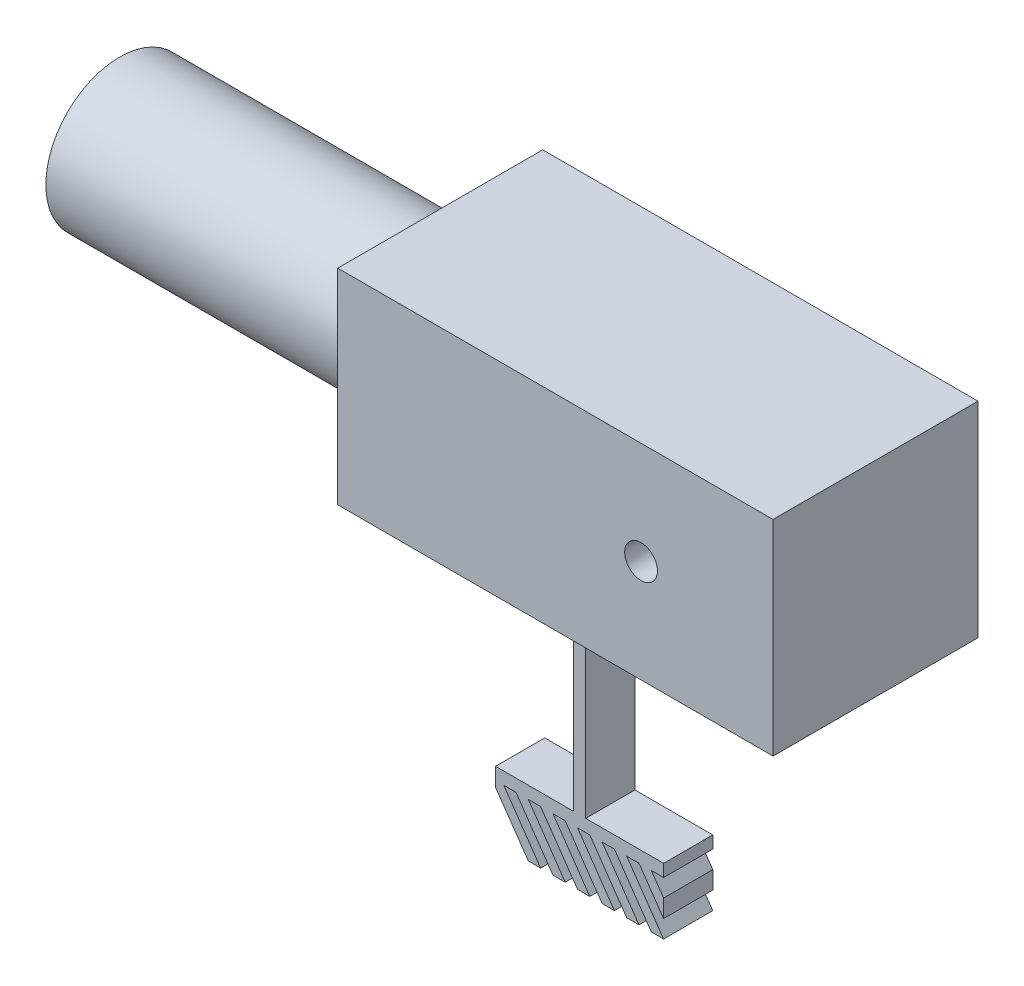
ISO-10303-21;
HEADER;
FILE_DESCRIPTION(('STEP AP214'),'2;1');
FILE_NAME('part.step','',(''),(''),'','','');
FILE_SCHEMA(('AUTOMOTIVE_DESIGN { 1 0 10303 214 1 1 1 1 }'));
ENDSEC;
DATA;
#1=APPLICATION_CONTEXT('core data for automotive mechanical design processes');
#2=APPLICATION_PROTOCOL_DEFINITION('international standard','automotive_design',2000,#1);
#3=PRODUCT_CONTEXT('',#1,'mechanical');
#4=PRODUCT('Part','Part','',(#3));
#5=PRODUCT_RELATED_PRODUCT_CATEGORY('part','',(#4));
#6=PRODUCT_DEFINITION_FORMATION('','',#4);
#7=PRODUCT_DEFINITION_CONTEXT('part definition',#1,'design');
#8=PRODUCT_DEFINITION('design','',#6,#7);
#9=PRODUCT_DEFINITION_SHAPE('','',#8);
#10=(LENGTH_UNIT() NAMED_UNIT(*) SI_UNIT(.MILLI.,.METRE.));
#11=(NAMED_UNIT(*) PLANE_ANGLE_UNIT() SI_UNIT($,.RADIAN.));
#12=(NAMED_UNIT(*) SI_UNIT($,.STERADIAN.) SOLID_ANGLE_UNIT());
#13=UNCERTAINTY_MEASURE_WITH_UNIT(LENGTH_MEASURE(1.E-05),#10,'distance_accuracy_value','');
#14=(GEOMETRIC_REPRESENTATION_CONTEXT(3) GLOBAL_UNCERTAINTY_ASSIGNED_CONTEXT((#13)) GLOBAL_UNIT_ASSIGNED_CONTEXT((#10,
#11,#12)) REPRESENTATION_CONTEXT('',''));
#15=CARTESIAN_POINT('',(0.,0.,0.));
#16=DIRECTION('',(0.,0.,1.));
#17=DIRECTION('',(1.,0.,0.));
#18=AXIS2_PLACEMENT_3D('',#15,#16,#17);
#19=CARTESIAN_POINT('',(-200.,-125.,-125.));
#20=DIRECTION('',(0.,0.,-1.));
#21=DIRECTION('',(-1.,0.,0.));
#22=AXIS2_PLACEMENT_3D('',#19,#20,#21);
#23=PLANE('',#22);
#24=DIRECTION('',(1.,0.,0.));
#25=VECTOR('',#24,1.);
#26=CARTESIAN_POINT('',(-200.,125.,-125.));
#27=LINE('',#26,#25);
#28=CARTESIAN_POINT('',(-200.,125.,-125.));
#29=VERTEX_POINT('',#28);
#30=CARTESIAN_POINT('',(331.,125.,-125.));
#31=VERTEX_POINT('',#30);
#32=EDGE_CURVE('E284',#29,#31,#27,.T.);
#33=ORIENTED_EDGE('',*,*,#32,.T.);
#34=DIRECTION('',(0.,1.,0.));
#35=VECTOR('',#34,1.);
#36=CARTESIAN_POINT('',(331.,-125.,-125.));
#37=LINE('',#36,#35);
#38=CARTESIAN_POINT('',(331.,-125.,-125.));
#39=VERTEX_POINT('',#38);
#40=EDGE_CURVE('E287',#39,#31,#37,.T.);
#41=ORIENTED_EDGE('',*,*,#40,.F.);
#42=DIRECTION('',(1.,0.,0.));
#43=VECTOR('',#42,1.);
#44=CARTESIAN_POINT('',(-200.,-125.,-125.));
#45=LINE('',#44,#43);
#46=CARTESIAN_POINT('',(-200.,-125.,-125.));
#47=VERTEX_POINT('',#46);
#48=EDGE_CURVE('E324',#47,#39,#45,.T.);
#49=ORIENTED_EDGE('',*,*,#48,.F.);
#50=DIRECTION('',(0.,1.,0.));
#51=VECTOR('',#50,1.);
#52=CARTESIAN_POINT('',(-200.,-125.,-125.));
#53=LINE('',#52,#51);
#54=EDGE_CURVE('E289',#47,#29,#53,.T.);
#55=ORIENTED_EDGE('',*,*,#54,.T.);
#56=EDGE_LOOP('',(#33,#41,#49,#55));
#57=FACE_BOUND('',#56,.T.);
#58=ADVANCED_FACE('F31',(#57),#23,.T.);
#59=CARTESIAN_POINT('',(-200.,-125.,125.));
#60=DIRECTION('',(0.,-1.,0.));
#61=DIRECTION('',(0.,0.,-1.));
#62=AXIS2_PLACEMENT_3D('',#59,#60,#61);
#63=PLANE('',#62);
#64=DIRECTION('',(0.,0.,-1.));
#65=VECTOR('',#64,1.);
#66=CARTESIAN_POINT('',(7.50000000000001,-125.,-30.));
#67=LINE('',#66,#65);
#68=CARTESIAN_POINT('',(7.5,-125.,30.));
#69=VERTEX_POINT('',#68);
#70=CARTESIAN_POINT('',(7.50000000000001,-125.,-30.));
#71=VERTEX_POINT('',#70);
#72=EDGE_CURVE('E326',#69,#71,#67,.T.);
#73=ORIENTED_EDGE('',*,*,#72,.T.);
#74=DIRECTION('',(-1.,0.,0.));
#75=VECTOR('',#74,1.);
#76=CARTESIAN_POINT('',(-7.50000000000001,-125.,-30.));
#77=LINE('',#76,#75);
#78=CARTESIAN_POINT('',(-7.50000000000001,-125.,-30.));
#79=VERTEX_POINT('',#78);
#80=EDGE_CURVE('E332',#71,#79,#77,.T.);
#81=ORIENTED_EDGE('',*,*,#80,.T.);
#82=DIRECTION('',(0.,0.,1.));
#83=VECTOR('',#82,1.);
#84=CARTESIAN_POINT('',(-7.50000000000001,-125.,-30.));
#85=LINE('',#84,#83);
#86=CARTESIAN_POINT('',(-7.50000000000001,-125.,30.));
#87=VERTEX_POINT('',#86);
#88=EDGE_CURVE('E47',#79,#87,#85,.T.);
#89=ORIENTED_EDGE('',*,*,#88,.T.);
#90=DIRECTION('',(-1.,0.,0.));
#91=VECTOR('',#90,1.);
#92=CARTESIAN_POINT('',(-7.50000000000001,-125.,30.));
#93=LINE('',#92,#91);
#94=EDGE_CURVE('E35',#69,#87,#93,.T.);
#95=ORIENTED_EDGE('',*,*,#94,.F.);
#96=EDGE_LOOP('',(#73,#81,#89,#95));
#97=FACE_BOUND('',#96,.T.);
#98=ORIENTED_EDGE('',*,*,#48,.T.);
#99=DIRECTION('',(0.,0.,-1.));
#100=VECTOR('',#99,1.);
#101=CARTESIAN_POINT('',(331.,-125.,125.));
#102=LINE('',#101,#100);
#103=CARTESIAN_POINT('',(331.,-125.,125.));
#104=VERTEX_POINT('',#103);
#105=EDGE_CURVE('E307',#104,#39,#102,.T.);
#106=ORIENTED_EDGE('',*,*,#105,.F.);
#107=DIRECTION('',(1.,0.,0.));
#108=VECTOR('',#107,1.);
#109=CARTESIAN_POINT('',(-200.,-125.,125.));
#110=LINE('',#109,#108);
#111=CARTESIAN_POINT('',(-200.,-125.,125.));
#112=VERTEX_POINT('',#111);
#113=EDGE_CURVE('E327',#112,#104,#110,.T.);
#114=ORIENTED_EDGE('',*,*,#113,.F.);
#115=DIRECTION('',(0.,0.,-1.));
#116=VECTOR('',#115,1.);
#117=CARTESIAN_POINT('',(-200.,-125.,125.));
#118=LINE('',#117,#116);
#119=EDGE_CURVE('E294',#112,#47,#118,.T.);
#120=ORIENTED_EDGE('',*,*,#119,.T.);
#121=EDGE_LOOP('',(#98,#106,#114,#120));
#122=FACE_BOUND('',#121,.T.);
#123=ADVANCED_FACE('F746',(#97,#122),#63,.T.);
#124=CARTESIAN_POINT('',(-200.,-125.,125.));
#125=DIRECTION('',(0.,0.,1.));
#126=DIRECTION('',(1.,0.,0.));
#127=AXIS2_PLACEMENT_3D('',#124,#125,#126);
#128=PLANE('',#127);
#129=CARTESIAN_POINT('',(170.,0.,125.));
#130=DIRECTION('',(0.,0.,1.));
#131=DIRECTION('',(1.,0.,0.));
#132=AXIS2_PLACEMENT_3D('',#129,#130,#131);
#133=CIRCLE('',#132,20.);
#134=CARTESIAN_POINT('',(190.,0.,125.));
#135=VERTEX_POINT('',#134);
#136=EDGE_CURVE('E1055',#135,#135,#133,.T.);
#137=ORIENTED_EDGE('',*,*,#136,.F.);
#138=EDGE_LOOP('',(#137));
#139=FACE_BOUND('',#138,.T.);
#140=ORIENTED_EDGE('',*,*,#113,.T.);
#141=DIRECTION('',(0.,-1.,0.));
#142=VECTOR('',#141,1.);
#143=CARTESIAN_POINT('',(331.,-125.,125.));
#144=LINE('',#143,#142);
#145=CARTESIAN_POINT('',(331.,125.,125.));
#146=VERTEX_POINT('',#145);
#147=EDGE_CURVE('E302',#146,#104,#144,.T.);
#148=ORIENTED_EDGE('',*,*,#147,.F.);
#149=DIRECTION('',(1.,0.,0.));
#150=VECTOR('',#149,1.);
#151=CARTESIAN_POINT('',(-200.,125.,125.));
#152=LINE('',#151,#150);
#153=CARTESIAN_POINT('',(-200.,125.,125.));
#154=VERTEX_POINT('',#153);
#155=EDGE_CURVE('E293',#154,#146,#152,.T.);
#156=ORIENTED_EDGE('',*,*,#155,.F.);
#157=DIRECTION('',(0.,-1.,0.));
#158=VECTOR('',#157,1.);
#159=CARTESIAN_POINT('',(-200.,-125.,125.));
#160=LINE('',#159,#158);
#161=EDGE_CURVE('E319',#154,#112,#160,.T.);
#162=ORIENTED_EDGE('',*,*,#161,.T.);
#163=EDGE_LOOP('',(#140,#148,#156,#162));
#164=FACE_BOUND('',#163,.T.);
#165=ADVANCED_FACE('F751',(#139,#164),#128,.T.);
#166=CARTESIAN_POINT('',(-200.,125.,125.));
#167=DIRECTION('',(0.,1.,0.));
#168=DIRECTION('',(0.,0.,1.));
#169=AXIS2_PLACEMENT_3D('',#166,#167,#168);
#170=PLANE('',#169);
#171=ORIENTED_EDGE('',*,*,#155,.T.);
#172=DIRECTION('',(0.,0.,1.));
#173=VECTOR('',#172,1.);
#174=CARTESIAN_POINT('',(331.,125.,125.));
#175=LINE('',#174,#173);
#176=EDGE_CURVE('E297',#31,#146,#175,.T.);
#177=ORIENTED_EDGE('',*,*,#176,.F.);
#178=ORIENTED_EDGE('',*,*,#32,.F.);
#179=DIRECTION('',(0.,0.,1.));
#180=VECTOR('',#179,1.);
#181=CARTESIAN_POINT('',(-200.,125.,125.));
#182=LINE('',#181,#180);
#183=EDGE_CURVE('E317',#29,#154,#182,.T.);
#184=ORIENTED_EDGE('',*,*,#183,.T.);
#185=EDGE_LOOP('',(#171,#177,#178,#184));
#186=FACE_BOUND('',#185,.T.);
#187=ADVANCED_FACE('F298',(#186),#170,.T.);
#188=CARTESIAN_POINT('',(-200.,125.,-125.));
#189=DIRECTION('',(-1.,0.,0.));
#190=DIRECTION('',(0.,0.,1.));
#191=AXIS2_PLACEMENT_3D('',#188,#189,#190);
#192=PLANE('',#191);
#193=CARTESIAN_POINT('',(-200.,0.,0.));
#194=DIRECTION('',(-1.,0.,0.));
#195=DIRECTION('',(0.,0.,1.));
#196=AXIS2_PLACEMENT_3D('',#193,#194,#195);
#197=CIRCLE('',#196,90.0324984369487);
#198=CARTESIAN_POINT('',(-200.,0.,90.0324984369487));
#199=VERTEX_POINT('',#198);
#200=EDGE_CURVE('E11',#199,#199,#197,.T.);
#201=ORIENTED_EDGE('',*,*,#200,.F.);
#202=EDGE_LOOP('',(#201));
#203=FACE_BOUND('',#202,.T.);
#204=ORIENTED_EDGE('',*,*,#54,.F.);
#205=ORIENTED_EDGE('',*,*,#119,.F.);
#206=ORIENTED_EDGE('',*,*,#161,.F.);
#207=ORIENTED_EDGE('',*,*,#183,.F.);
#208=EDGE_LOOP('',(#204,#205,#206,#207));
#209=FACE_BOUND('',#208,.T.);
#210=ADVANCED_FACE('F966',(#203,#209),#192,.T.);
#211=CARTESIAN_POINT('',(331.,125.,-125.));
#212=DIRECTION('',(-1.,0.,0.));
#213=DIRECTION('',(0.,0.,1.));
#214=AXIS2_PLACEMENT_3D('',#211,#212,#213);
#215=PLANE('',#214);
#216=ORIENTED_EDGE('',*,*,#40,.T.);
#217=ORIENTED_EDGE('',*,*,#176,.T.);
#218=ORIENTED_EDGE('',*,*,#147,.T.);
#219=ORIENTED_EDGE('',*,*,#105,.T.);
#220=EDGE_LOOP('',(#216,#217,#218,#219));
#221=FACE_BOUND('',#220,.T.);
#222=ADVANCED_FACE('F305',(#221),#215,.F.);
#223=CARTESIAN_POINT('',(-7.5,-400.,-30.));
#224=DIRECTION('',(-1.,0.,0.));
#225=DIRECTION('',(0.,-1.,0.));
#226=AXIS2_PLACEMENT_3D('',#223,#224,#225);
#227=PLANE('',#226);
#228=ORIENTED_EDGE('',*,*,#88,.F.);
#229=DIRECTION('',(0.,-1.,0.));
#230=VECTOR('',#229,1.);
#231=CARTESIAN_POINT('',(-7.5,-400.,-30.));
#232=LINE('',#231,#230);
#233=CARTESIAN_POINT('',(-7.5,-400.,-30.));
#234=VERTEX_POINT('',#233);
#235=EDGE_CURVE('E435',#79,#234,#232,.T.);
#236=ORIENTED_EDGE('',*,*,#235,.T.);
#237=DIRECTION('',(0.,0.,1.));
#238=VECTOR('',#237,1.);
#239=CARTESIAN_POINT('',(-7.5,-400.,-30.));
#240=LINE('',#239,#238);
#241=CARTESIAN_POINT('',(-7.5,-400.,30.));
#242=VERTEX_POINT('',#241);
#243=EDGE_CURVE('E535',#234,#242,#240,.T.);
#244=ORIENTED_EDGE('',*,*,#243,.T.);
#245=DIRECTION('',(0.,-1.,0.));
#246=VECTOR('',#245,1.);
#247=CARTESIAN_POINT('',(-7.5,-400.,30.));
#248=LINE('',#247,#246);
#249=EDGE_CURVE('E334',#87,#242,#248,.T.);
#250=ORIENTED_EDGE('',*,*,#249,.F.);
#251=EDGE_LOOP('',(#228,#236,#244,#250));
#252=FACE_BOUND('',#251,.T.);
#253=ADVANCED_FACE('F33',(#252),#227,.T.);
#254=CARTESIAN_POINT('',(7.50000000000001,0.,-30.));
#255=DIRECTION('',(1.,0.,0.));
#256=DIRECTION('',(0.,1.,0.));
#257=AXIS2_PLACEMENT_3D('',#254,#255,#256);
#258=PLANE('',#257);
#259=ORIENTED_EDGE('',*,*,#72,.F.);
#260=DIRECTION('',(0.,1.,0.));
#261=VECTOR('',#260,1.);
#262=CARTESIAN_POINT('',(7.50000000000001,0.,30.));
#263=LINE('',#262,#261);
#264=CARTESIAN_POINT('',(7.5,-400.,30.));
#265=VERTEX_POINT('',#264);
#266=EDGE_CURVE('E432',#265,#69,#263,.T.);
#267=ORIENTED_EDGE('',*,*,#266,.F.);
#268=DIRECTION('',(0.,0.,1.));
#269=VECTOR('',#268,1.);
#270=CARTESIAN_POINT('',(7.5,-400.,-30.));
#271=LINE('',#270,#269);
#272=CARTESIAN_POINT('',(7.5,-400.,-30.));
#273=VERTEX_POINT('',#272);
#274=EDGE_CURVE('E55',#273,#265,#271,.T.);
#275=ORIENTED_EDGE('',*,*,#274,.F.);
#276=DIRECTION('',(0.,1.,0.));
#277=VECTOR('',#276,1.);
#278=CARTESIAN_POINT('',(7.50000000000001,0.,-30.));
#279=LINE('',#278,#277);
#280=EDGE_CURVE('E533',#273,#71,#279,.T.);
#281=ORIENTED_EDGE('',*,*,#280,.T.);
#282=EDGE_LOOP('',(#259,#267,#275,#281));
#283=FACE_BOUND('',#282,.T.);
#284=ADVANCED_FACE('F737',(#283),#258,.T.);
#285=CARTESIAN_POINT('',(7.5,-400.,-30.));
#286=DIRECTION('',(0.,1.,0.));
#287=DIRECTION('',(0.,0.,1.));
#288=AXIS2_PLACEMENT_3D('',#285,#286,#287);
#289=PLANE('',#288);
#290=ORIENTED_EDGE('',*,*,#274,.T.);
#291=DIRECTION('',(-1.,0.,0.));
#292=VECTOR('',#291,1.);
#293=CARTESIAN_POINT('',(7.5,-400.,30.));
#294=LINE('',#293,#292);
#295=CARTESIAN_POINT('',(102.5,-400.,30.));
#296=VERTEX_POINT('',#295);
#297=EDGE_CURVE('E429',#296,#265,#294,.T.);
#298=ORIENTED_EDGE('',*,*,#297,.F.);
#299=DIRECTION('',(0.,0.,1.));
#300=VECTOR('',#299,1.);
#301=CARTESIAN_POINT('',(102.5,-400.,-30.));
#302=LINE('',#301,#300);
#303=CARTESIAN_POINT('',(102.5,-400.,-30.));
#304=VERTEX_POINT('',#303);
#305=EDGE_CURVE('E537',#304,#296,#302,.T.);
#306=ORIENTED_EDGE('',*,*,#305,.F.);
#307=DIRECTION('',(-1.,0.,0.));
#308=VECTOR('',#307,1.);
#309=CARTESIAN_POINT('',(7.5,-400.,-30.));
#310=LINE('',#309,#308);
#311=EDGE_CURVE('E530',#304,#273,#310,.T.);
#312=ORIENTED_EDGE('',*,*,#311,.T.);
#313=EDGE_LOOP('',(#290,#298,#306,#312));
#314=FACE_BOUND('',#313,.T.);
#315=ADVANCED_FACE('F735',(#314),#289,.T.);
#316=CARTESIAN_POINT('',(102.5,-400.,-30.));
#317=DIRECTION('',(1.,0.,0.));
#318=DIRECTION('',(0.,1.,0.));
#319=AXIS2_PLACEMENT_3D('',#316,#317,#318);
#320=PLANE('',#319);
#321=ORIENTED_EDGE('',*,*,#305,.T.);
#322=DIRECTION('',(0.,1.,0.));
#323=VECTOR('',#322,1.);
#324=CARTESIAN_POINT('',(102.5,-400.,30.));
#325=LINE('',#324,#323);
#326=CARTESIAN_POINT('',(102.5,-415.,30.));
#327=VERTEX_POINT('',#326);
#328=EDGE_CURVE('E426',#327,#296,#325,.T.);
#329=ORIENTED_EDGE('',*,*,#328,.F.);
#330=DIRECTION('',(0.,0.,1.));
#331=VECTOR('',#330,1.);
#332=CARTESIAN_POINT('',(102.5,-415.,-30.));
#333=LINE('',#332,#331);
#334=CARTESIAN_POINT('',(102.5,-415.,-30.));
#335=VERTEX_POINT('',#334);
#336=EDGE_CURVE('E539',#335,#327,#333,.T.);
#337=ORIENTED_EDGE('',*,*,#336,.F.);
#338=DIRECTION('',(0.,1.,0.));
#339=VECTOR('',#338,1.);
#340=CARTESIAN_POINT('',(102.5,-400.,-30.));
#341=LINE('',#340,#339);
#342=EDGE_CURVE('E527',#335,#304,#341,.T.);
#343=ORIENTED_EDGE('',*,*,#342,.T.);
#344=EDGE_LOOP('',(#321,#329,#337,#343));
#345=FACE_BOUND('',#344,.T.);
#346=ADVANCED_FACE('F731',(#345),#320,.T.);
#347=CARTESIAN_POINT('',(102.5,-415.,-30.));
#348=DIRECTION('',(0.,-1.,0.));
#349=DIRECTION('',(0.,0.,-1.));
#350=AXIS2_PLACEMENT_3D('',#347,#348,#349);
#351=PLANE('',#350);
#352=ORIENTED_EDGE('',*,*,#336,.T.);
#353=DIRECTION('',(1.,0.,0.));
#354=VECTOR('',#353,1.);
#355=CARTESIAN_POINT('',(102.5,-415.,30.));
#356=LINE('',#355,#354);
#357=CARTESIAN_POINT('',(87.5,-415.,30.));
#358=VERTEX_POINT('',#357);
#359=EDGE_CURVE('E423',#358,#327,#356,.T.);
#360=ORIENTED_EDGE('',*,*,#359,.F.);
#361=DIRECTION('',(0.,0.,1.));
#362=VECTOR('',#361,1.);
#363=CARTESIAN_POINT('',(87.5,-415.,-30.));
#364=LINE('',#363,#362);
#365=CARTESIAN_POINT('',(87.5,-415.,-30.));
#366=VERTEX_POINT('',#365);
#367=EDGE_CURVE('E541',#366,#358,#364,.T.);
#368=ORIENTED_EDGE('',*,*,#367,.F.);
#369=DIRECTION('',(1.,0.,0.));
#370=VECTOR('',#369,1.);
#371=CARTESIAN_POINT('',(102.5,-415.,-30.));
#372=LINE('',#371,#370);
#373=EDGE_CURVE('E524',#366,#335,#372,.T.);
#374=ORIENTED_EDGE('',*,*,#373,.T.);
#375=EDGE_LOOP('',(#352,#360,#368,#374));
#376=FACE_BOUND('',#375,.T.);
#377=ADVANCED_FACE('F727',(#376),#351,.T.);
#378=CARTESIAN_POINT('',(87.5,-415.,-30.));
#379=DIRECTION('',(0.822192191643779,0.569209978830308,0.));
#380=DIRECTION('',(-0.569209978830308,0.822192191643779,0.));
#381=AXIS2_PLACEMENT_3D('',#378,#379,#380);
#382=PLANE('',#381);
#383=ORIENTED_EDGE('',*,*,#367,.T.);
#384=DIRECTION('',(-0.569209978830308,0.822192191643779,0.));
#385=VECTOR('',#384,1.);
#386=CARTESIAN_POINT('',(87.5,-415.,30.));
#387=LINE('',#386,#385);
#388=CARTESIAN_POINT('',(102.5,-436.666666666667,30.));
#389=VERTEX_POINT('',#388);
#390=EDGE_CURVE('E420',#389,#358,#387,.T.);
#391=ORIENTED_EDGE('',*,*,#390,.F.);
#392=DIRECTION('',(0.,0.,1.));
#393=VECTOR('',#392,1.);
#394=CARTESIAN_POINT('',(102.5,-436.666666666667,-30.));
#395=LINE('',#394,#393);
#396=CARTESIAN_POINT('',(102.5,-436.666666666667,-30.));
#397=VERTEX_POINT('',#396);
#398=EDGE_CURVE('E543',#397,#389,#395,.T.);
#399=ORIENTED_EDGE('',*,*,#398,.F.);
#400=DIRECTION('',(-0.569209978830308,0.822192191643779,0.));
#401=VECTOR('',#400,1.);
#402=CARTESIAN_POINT('',(87.5,-415.,-30.));
#403=LINE('',#402,#401);
#404=EDGE_CURVE('E521',#397,#366,#403,.T.);
#405=ORIENTED_EDGE('',*,*,#404,.T.);
#406=EDGE_LOOP('',(#383,#391,#399,#405));
#407=FACE_BOUND('',#406,.T.);
#408=ADVANCED_FACE('F725',(#407),#382,.T.);
#409=CARTESIAN_POINT('',(102.5,-436.666666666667,-30.));
#410=DIRECTION('',(1.,0.,0.));
#411=DIRECTION('',(0.,0.,-1.));
#412=AXIS2_PLACEMENT_3D('',#409,#410,#411);
#413=PLANE('',#412);
#414=ORIENTED_EDGE('',*,*,#398,.T.);
#415=DIRECTION('',(0.,1.,0.));
#416=VECTOR('',#415,1.);
#417=CARTESIAN_POINT('',(102.5,-436.666666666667,30.));
#418=LINE('',#417,#416);
#419=CARTESIAN_POINT('',(102.5,-458.333333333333,30.));
#420=VERTEX_POINT('',#419);
#421=EDGE_CURVE('E417',#420,#389,#418,.T.);
#422=ORIENTED_EDGE('',*,*,#421,.F.);
#423=DIRECTION('',(0.,0.,1.));
#424=VECTOR('',#423,1.);
#425=CARTESIAN_POINT('',(102.5,-458.333333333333,-30.));
#426=LINE('',#425,#424);
#427=CARTESIAN_POINT('',(102.5,-458.333333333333,-30.));
#428=VERTEX_POINT('',#427);
#429=EDGE_CURVE('E545',#428,#420,#426,.T.);
#430=ORIENTED_EDGE('',*,*,#429,.F.);
#431=DIRECTION('',(0.,1.,0.));
#432=VECTOR('',#431,1.);
#433=CARTESIAN_POINT('',(102.5,-436.666666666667,-30.));
#434=LINE('',#433,#432);
#435=EDGE_CURVE('E518',#428,#397,#434,.T.);
#436=ORIENTED_EDGE('',*,*,#435,.T.);
#437=EDGE_LOOP('',(#414,#422,#430,#436));
#438=FACE_BOUND('',#437,.T.);
#439=ADVANCED_FACE('F720',(#438),#413,.T.);
#440=CARTESIAN_POINT('',(102.5,-458.333333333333,-30.));
#441=DIRECTION('',(-0.822192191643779,-0.569209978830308,0.));
#442=DIRECTION('',(0.569209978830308,-0.822192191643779,0.));
#443=AXIS2_PLACEMENT_3D('',#440,#441,#442);
#444=PLANE('',#443);
#445=ORIENTED_EDGE('',*,*,#429,.T.);
#446=DIRECTION('',(0.569209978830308,-0.822192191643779,0.));
#447=VECTOR('',#446,1.);
#448=CARTESIAN_POINT('',(102.5,-458.333333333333,30.));
#449=LINE('',#448,#447);
#450=CARTESIAN_POINT('',(72.5,-415.,30.));
#451=VERTEX_POINT('',#450);
#452=EDGE_CURVE('E414',#451,#420,#449,.T.);
#453=ORIENTED_EDGE('',*,*,#452,.F.);
#454=DIRECTION('',(0.,0.,1.));
#455=VECTOR('',#454,1.);
#456=CARTESIAN_POINT('',(72.5,-415.,-30.));
#457=LINE('',#456,#455);
#458=CARTESIAN_POINT('',(72.5,-415.,-30.));
#459=VERTEX_POINT('',#458);
#460=EDGE_CURVE('E547',#459,#451,#457,.T.);
#461=ORIENTED_EDGE('',*,*,#460,.F.);
#462=DIRECTION('',(0.569209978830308,-0.822192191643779,0.));
#463=VECTOR('',#462,1.);
#464=CARTESIAN_POINT('',(102.5,-458.333333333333,-30.));
#465=LINE('',#464,#463);
#466=EDGE_CURVE('E515',#459,#428,#465,.T.);
#467=ORIENTED_EDGE('',*,*,#466,.T.);
#468=EDGE_LOOP('',(#445,#453,#461,#467));
#469=FACE_BOUND('',#468,.T.);
#470=ADVANCED_FACE('F715',(#469),#444,.T.);
#471=CARTESIAN_POINT('',(72.5,-415.,-30.));
#472=DIRECTION('',(0.,-1.,0.));
#473=DIRECTION('',(0.,0.,-1.));
#474=AXIS2_PLACEMENT_3D('',#471,#472,#473);
#475=PLANE('',#474);
#476=ORIENTED_EDGE('',*,*,#460,.T.);
#477=DIRECTION('',(1.,0.,0.));
#478=VECTOR('',#477,1.);
#479=CARTESIAN_POINT('',(72.5,-415.,30.));
#480=LINE('',#479,#478);
#481=CARTESIAN_POINT('',(57.5,-415.,30.));
#482=VERTEX_POINT('',#481);
#483=EDGE_CURVE('E411',#482,#451,#480,.T.);
#484=ORIENTED_EDGE('',*,*,#483,.F.);
#485=DIRECTION('',(0.,0.,1.));
#486=VECTOR('',#485,1.);
#487=CARTESIAN_POINT('',(57.5,-415.,-30.));
#488=LINE('',#487,#486);
#489=CARTESIAN_POINT('',(57.5,-415.,-30.));
#490=VERTEX_POINT('',#489);
#491=EDGE_CURVE('E549',#490,#482,#488,.T.);
#492=ORIENTED_EDGE('',*,*,#491,.F.);
#493=DIRECTION('',(1.,0.,0.));
#494=VECTOR('',#493,1.);
#495=CARTESIAN_POINT('',(72.5,-415.,-30.));
#496=LINE('',#495,#494);
#497=EDGE_CURVE('E512',#490,#459,#496,.T.);
#498=ORIENTED_EDGE('',*,*,#497,.T.);
#499=EDGE_LOOP('',(#476,#484,#492,#498));
#500=FACE_BOUND('',#499,.T.);
#501=ADVANCED_FACE('F713',(#500),#475,.T.);
#502=CARTESIAN_POINT('',(57.5,-415.,-30.));
#503=DIRECTION('',(0.822192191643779,0.569209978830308,0.));
#504=DIRECTION('',(-0.569209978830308,0.822192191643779,0.));
#505=AXIS2_PLACEMENT_3D('',#502,#503,#504);
#506=PLANE('',#505);
#507=ORIENTED_EDGE('',*,*,#491,.T.);
#508=DIRECTION('',(-0.569209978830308,0.822192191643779,0.));
#509=VECTOR('',#508,1.);
#510=CARTESIAN_POINT('',(57.5,-415.,30.));
#511=LINE('',#510,#509);
#512=CARTESIAN_POINT('',(102.5,-480.,30.));
#513=VERTEX_POINT('',#512);
#514=EDGE_CURVE('E408',#513,#482,#511,.T.);
#515=ORIENTED_EDGE('',*,*,#514,.F.);
#516=DIRECTION('',(0.,0.,1.));
#517=VECTOR('',#516,1.);
#518=CARTESIAN_POINT('',(102.5,-480.,-30.));
#519=LINE('',#518,#517);
#520=CARTESIAN_POINT('',(102.5,-480.,-30.));
#521=VERTEX_POINT('',#520);
#522=EDGE_CURVE('E551',#521,#513,#519,.T.);
#523=ORIENTED_EDGE('',*,*,#522,.F.);
#524=DIRECTION('',(-0.569209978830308,0.822192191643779,0.));
#525=VECTOR('',#524,1.);
#526=CARTESIAN_POINT('',(57.5,-415.,-30.));
#527=LINE('',#526,#525);
#528=EDGE_CURVE('E509',#521,#490,#527,.T.);
#529=ORIENTED_EDGE('',*,*,#528,.T.);
#530=EDGE_LOOP('',(#507,#515,#523,#529));
#531=FACE_BOUND('',#530,.T.);
#532=ADVANCED_FACE('F708',(#531),#506,.T.);
#533=CARTESIAN_POINT('',(102.5,-480.,-30.));
#534=DIRECTION('',(0.,-1.,0.));
#535=DIRECTION('',(1.,0.,0.));
#536=AXIS2_PLACEMENT_3D('',#533,#534,#535);
#537=PLANE('',#536);
#538=ORIENTED_EDGE('',*,*,#522,.T.);
#539=DIRECTION('',(1.,0.,0.));
#540=VECTOR('',#539,1.);
#541=CARTESIAN_POINT('',(102.5,-480.,30.));
#542=LINE('',#541,#540);
#543=CARTESIAN_POINT('',(87.5,-480.,30.));
#544=VERTEX_POINT('',#543);
#545=EDGE_CURVE('E405',#544,#513,#542,.T.);
#546=ORIENTED_EDGE('',*,*,#545,.F.);
#547=DIRECTION('',(0.,0.,1.));
#548=VECTOR('',#547,1.);
#549=CARTESIAN_POINT('',(87.5,-480.,-30.));
#550=LINE('',#549,#548);
#551=CARTESIAN_POINT('',(87.5,-480.,-30.));
#552=VERTEX_POINT('',#551);
#553=EDGE_CURVE('E553',#552,#544,#550,.T.);
#554=ORIENTED_EDGE('',*,*,#553,.F.);
#555=DIRECTION('',(1.,0.,0.));
#556=VECTOR('',#555,1.);
#557=CARTESIAN_POINT('',(102.5,-480.,-30.));
#558=LINE('',#557,#556);
#559=EDGE_CURVE('E506',#552,#521,#558,.T.);
#560=ORIENTED_EDGE('',*,*,#559,.T.);
#561=EDGE_LOOP('',(#538,#546,#554,#560));
#562=FACE_BOUND('',#561,.T.);
#563=ADVANCED_FACE('F703',(#562),#537,.T.);
#564=CARTESIAN_POINT('',(87.5,-480.,-30.));
#565=DIRECTION('',(-0.822192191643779,-0.569209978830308,0.));
#566=DIRECTION('',(0.569209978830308,-0.822192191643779,0.));
#567=AXIS2_PLACEMENT_3D('',#564,#565,#566);
#568=PLANE('',#567);
#569=ORIENTED_EDGE('',*,*,#553,.T.);
#570=DIRECTION('',(0.569209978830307,-0.822192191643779,0.));
#571=VECTOR('',#570,1.);
#572=CARTESIAN_POINT('',(87.5,-480.,30.));
#573=LINE('',#572,#571);
#574=CARTESIAN_POINT('',(42.5000000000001,-415.,30.));
#575=VERTEX_POINT('',#574);
#576=EDGE_CURVE('E402',#575,#544,#573,.T.);
#577=ORIENTED_EDGE('',*,*,#576,.F.);
#578=DIRECTION('',(0.,0.,1.));
#579=VECTOR('',#578,1.);
#580=CARTESIAN_POINT('',(42.5000000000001,-415.,-30.));
#581=LINE('',#580,#579);
#582=CARTESIAN_POINT('',(42.5000000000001,-415.,-30.));
#583=VERTEX_POINT('',#582);
#584=EDGE_CURVE('E555',#583,#575,#581,.T.);
#585=ORIENTED_EDGE('',*,*,#584,.F.);
#586=DIRECTION('',(0.569209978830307,-0.822192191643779,0.));
#587=VECTOR('',#586,1.);
#588=CARTESIAN_POINT('',(87.5,-480.,-30.));
#589=LINE('',#588,#587);
#590=EDGE_CURVE('E503',#583,#552,#589,.T.);
#591=ORIENTED_EDGE('',*,*,#590,.T.);
#592=EDGE_LOOP('',(#569,#577,#585,#591));
#593=FACE_BOUND('',#592,.T.);
#594=ADVANCED_FACE('F701',(#593),#568,.T.);
#595=CARTESIAN_POINT('',(42.5000000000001,-415.,-30.));
#596=DIRECTION('',(0.,-1.,0.));
#597=DIRECTION('',(0.,0.,-1.));
#598=AXIS2_PLACEMENT_3D('',#595,#596,#597);
#599=PLANE('',#598);
#600=ORIENTED_EDGE('',*,*,#584,.T.);
#601=DIRECTION('',(1.,0.,0.));
#602=VECTOR('',#601,1.);
#603=CARTESIAN_POINT('',(42.5000000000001,-415.,30.));
#604=LINE('',#603,#602);
#605=CARTESIAN_POINT('',(27.5000000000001,-415.,30.));
#606=VERTEX_POINT('',#605);
#607=EDGE_CURVE('E399',#606,#575,#604,.T.);
#608=ORIENTED_EDGE('',*,*,#607,.F.);
#609=DIRECTION('',(0.,0.,1.));
#610=VECTOR('',#609,1.);
#611=CARTESIAN_POINT('',(27.5000000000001,-415.,-30.));
#612=LINE('',#611,#610);
#613=CARTESIAN_POINT('',(27.5000000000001,-415.,-30.));
#614=VERTEX_POINT('',#613);
#615=EDGE_CURVE('E557',#614,#606,#612,.T.);
#616=ORIENTED_EDGE('',*,*,#615,.F.);
#617=DIRECTION('',(1.,0.,0.));
#618=VECTOR('',#617,1.);
#619=CARTESIAN_POINT('',(42.5000000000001,-415.,-30.));
#620=LINE('',#619,#618);
#621=EDGE_CURVE('E500',#614,#583,#620,.T.);
#622=ORIENTED_EDGE('',*,*,#621,.T.);
#623=EDGE_LOOP('',(#600,#608,#616,#622));
#624=FACE_BOUND('',#623,.T.);
#625=ADVANCED_FACE('F696',(#624),#599,.T.);
#626=CARTESIAN_POINT('',(27.5000000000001,-415.,-30.));
#627=DIRECTION('',(0.822192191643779,0.569209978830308,0.));
#628=DIRECTION('',(-0.569209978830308,0.822192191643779,0.));
#629=AXIS2_PLACEMENT_3D('',#626,#627,#628);
#630=PLANE('',#629);
#631=ORIENTED_EDGE('',*,*,#615,.T.);
#632=DIRECTION('',(-0.569209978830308,0.822192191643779,0.));
#633=VECTOR('',#632,1.);
#634=CARTESIAN_POINT('',(27.5000000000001,-415.,30.));
#635=LINE('',#634,#633);
#636=CARTESIAN_POINT('',(72.5,-480.,30.));
#637=VERTEX_POINT('',#636);
#638=EDGE_CURVE('E396',#637,#606,#635,.T.);
#639=ORIENTED_EDGE('',*,*,#638,.F.);
#640=DIRECTION('',(0.,0.,1.));
#641=VECTOR('',#640,1.);
#642=CARTESIAN_POINT('',(72.5,-480.,-30.));
#643=LINE('',#642,#641);
#644=CARTESIAN_POINT('',(72.5,-480.,-30.));
#645=VERTEX_POINT('',#644);
#646=EDGE_CURVE('E559',#645,#637,#643,.T.);
#647=ORIENTED_EDGE('',*,*,#646,.F.);
#648=DIRECTION('',(-0.569209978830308,0.822192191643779,0.));
#649=VECTOR('',#648,1.);
#650=CARTESIAN_POINT('',(27.5000000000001,-415.,-30.));
#651=LINE('',#650,#649);
#652=EDGE_CURVE('E497',#645,#614,#651,.T.);
#653=ORIENTED_EDGE('',*,*,#652,.T.);
#654=EDGE_LOOP('',(#631,#639,#647,#653));
#655=FACE_BOUND('',#654,.T.);
#656=ADVANCED_FACE('F691',(#655),#630,.T.);
#657=CARTESIAN_POINT('',(72.5,-480.,-30.));
#658=DIRECTION('',(0.,-1.,0.));
#659=DIRECTION('',(0.,0.,-1.));
#660=AXIS2_PLACEMENT_3D('',#657,#658,#659);
#661=PLANE('',#660);
#662=ORIENTED_EDGE('',*,*,#646,.T.);
#663=DIRECTION('',(1.,0.,0.));
#664=VECTOR('',#663,1.);
#665=CARTESIAN_POINT('',(72.5,-480.,30.));
#666=LINE('',#665,#664);
#667=CARTESIAN_POINT('',(57.5,-480.,30.));
#668=VERTEX_POINT('',#667);
#669=EDGE_CURVE('E393',#668,#637,#666,.T.);
#670=ORIENTED_EDGE('',*,*,#669,.F.);
#671=DIRECTION('',(0.,0.,1.));
#672=VECTOR('',#671,1.);
#673=CARTESIAN_POINT('',(57.5,-480.,-30.));
#674=LINE('',#673,#672);
#675=CARTESIAN_POINT('',(57.5,-480.,-30.));
#676=VERTEX_POINT('',#675);
#677=EDGE_CURVE('E561',#676,#668,#674,.T.);
#678=ORIENTED_EDGE('',*,*,#677,.F.);
#679=DIRECTION('',(1.,0.,0.));
#680=VECTOR('',#679,1.);
#681=CARTESIAN_POINT('',(72.5,-480.,-30.));
#682=LINE('',#681,#680);
#683=EDGE_CURVE('E494',#676,#645,#682,.T.);
#684=ORIENTED_EDGE('',*,*,#683,.T.);
#685=EDGE_LOOP('',(#662,#670,#678,#684));
#686=FACE_BOUND('',#685,.T.);
#687=ADVANCED_FACE('F689',(#686),#661,.T.);
#688=CARTESIAN_POINT('',(57.5,-480.,-30.));
#689=DIRECTION('',(-0.822192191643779,-0.569209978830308,0.));
#690=DIRECTION('',(0.569209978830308,-0.822192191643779,0.));
#691=AXIS2_PLACEMENT_3D('',#688,#689,#690);
#692=PLANE('',#691);
#693=ORIENTED_EDGE('',*,*,#677,.T.);
#694=DIRECTION('',(0.569209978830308,-0.822192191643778,0.));
#695=VECTOR('',#694,1.);
#696=CARTESIAN_POINT('',(57.5,-480.,30.));
#697=LINE('',#696,#695);
#698=CARTESIAN_POINT('',(12.5,-415.,30.));
#699=VERTEX_POINT('',#698);
#700=EDGE_CURVE('E390',#699,#668,#697,.T.);
#701=ORIENTED_EDGE('',*,*,#700,.F.);
#702=DIRECTION('',(0.,0.,1.));
#703=VECTOR('',#702,1.);
#704=CARTESIAN_POINT('',(12.5,-415.,-30.));
#705=LINE('',#704,#703);
#706=CARTESIAN_POINT('',(12.5,-415.,-30.));
#707=VERTEX_POINT('',#706);
#708=EDGE_CURVE('E563',#707,#699,#705,.T.);
#709=ORIENTED_EDGE('',*,*,#708,.F.);
#710=DIRECTION('',(0.569209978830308,-0.822192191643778,0.));
#711=VECTOR('',#710,1.);
#712=CARTESIAN_POINT('',(57.5,-480.,-30.));
#713=LINE('',#712,#711);
#714=EDGE_CURVE('E491',#707,#676,#713,.T.);
#715=ORIENTED_EDGE('',*,*,#714,.T.);
#716=EDGE_LOOP('',(#693,#701,#709,#715));
#717=FACE_BOUND('',#716,.T.);
#718=ADVANCED_FACE('F684',(#717),#692,.T.);
#719=CARTESIAN_POINT('',(12.5,-415.,-30.));
#720=DIRECTION('',(0.,-1.,0.));
#721=DIRECTION('',(0.,0.,-1.));
#722=AXIS2_PLACEMENT_3D('',#719,#720,#721);
#723=PLANE('',#722);
#724=ORIENTED_EDGE('',*,*,#708,.T.);
#725=DIRECTION('',(1.,0.,0.));
#726=VECTOR('',#725,1.);
#727=CARTESIAN_POINT('',(12.5,-415.,30.));
#728=LINE('',#727,#726);
#729=CARTESIAN_POINT('',(-2.5,-415.,30.));
#730=VERTEX_POINT('',#729);
#731=EDGE_CURVE('E387',#730,#699,#728,.T.);
#732=ORIENTED_EDGE('',*,*,#731,.F.);
#733=DIRECTION('',(0.,0.,1.));
#734=VECTOR('',#733,1.);
#735=CARTESIAN_POINT('',(-2.5,-415.,-30.));
#736=LINE('',#735,#734);
#737=CARTESIAN_POINT('',(-2.5,-415.,-30.));
#738=VERTEX_POINT('',#737);
#739=EDGE_CURVE('E565',#738,#730,#736,.T.);
#740=ORIENTED_EDGE('',*,*,#739,.F.);
#741=DIRECTION('',(1.,0.,0.));
#742=VECTOR('',#741,1.);
#743=CARTESIAN_POINT('',(12.5,-415.,-30.));
#744=LINE('',#743,#742);
#745=EDGE_CURVE('E488',#738,#707,#744,.T.);
#746=ORIENTED_EDGE('',*,*,#745,.T.);
#747=EDGE_LOOP('',(#724,#732,#740,#746));
#748=FACE_BOUND('',#747,.T.);
#749=ADVANCED_FACE('F679',(#748),#723,.T.);
#750=CARTESIAN_POINT('',(-2.5,-415.,-30.));
#751=DIRECTION('',(0.822192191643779,0.569209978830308,0.));
#752=DIRECTION('',(-0.569209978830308,0.822192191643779,0.));
#753=AXIS2_PLACEMENT_3D('',#750,#751,#752);
#754=PLANE('',#753);
#755=ORIENTED_EDGE('',*,*,#739,.T.);
#756=DIRECTION('',(-0.569209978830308,0.822192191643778,0.));
#757=VECTOR('',#756,1.);
#758=CARTESIAN_POINT('',(-2.5,-415.,30.));
#759=LINE('',#758,#757);
#760=CARTESIAN_POINT('',(42.5,-480.,30.));
#761=VERTEX_POINT('',#760);
#762=EDGE_CURVE('E384',#761,#730,#759,.T.);
#763=ORIENTED_EDGE('',*,*,#762,.F.);
#764=DIRECTION('',(0.,0.,1.));
#765=VECTOR('',#764,1.);
#766=CARTESIAN_POINT('',(42.5,-480.,-30.));
#767=LINE('',#766,#765);
#768=CARTESIAN_POINT('',(42.5,-480.,-30.));
#769=VERTEX_POINT('',#768);
#770=EDGE_CURVE('E567',#769,#761,#767,.T.);
#771=ORIENTED_EDGE('',*,*,#770,.F.);
#772=DIRECTION('',(-0.569209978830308,0.822192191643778,0.));
#773=VECTOR('',#772,1.);
#774=CARTESIAN_POINT('',(-2.5,-415.,-30.));
#775=LINE('',#774,#773);
#776=EDGE_CURVE('E485',#769,#738,#775,.T.);
#777=ORIENTED_EDGE('',*,*,#776,.T.);
#778=EDGE_LOOP('',(#755,#763,#771,#777));
#779=FACE_BOUND('',#778,.T.);
#780=ADVANCED_FACE('F677',(#779),#754,.T.);
#781=CARTESIAN_POINT('',(42.5,-480.,-30.));
#782=DIRECTION('',(0.,-1.,0.));
#783=DIRECTION('',(1.,0.,0.));
#784=AXIS2_PLACEMENT_3D('',#781,#782,#783);
#785=PLANE('',#784);
#786=ORIENTED_EDGE('',*,*,#770,.T.);
#787=DIRECTION('',(1.,0.,0.));
#788=VECTOR('',#787,1.);
#789=CARTESIAN_POINT('',(42.5,-480.,30.));
#790=LINE('',#789,#788);
#791=CARTESIAN_POINT('',(27.5,-480.,30.));
#792=VERTEX_POINT('',#791);
#793=EDGE_CURVE('E381',#792,#761,#790,.T.);
#794=ORIENTED_EDGE('',*,*,#793,.F.);
#795=DIRECTION('',(0.,0.,1.));
#796=VECTOR('',#795,1.);
#797=CARTESIAN_POINT('',(27.5,-480.,-30.));
#798=LINE('',#797,#796);
#799=CARTESIAN_POINT('',(27.5,-480.,-30.));
#800=VERTEX_POINT('',#799);
#801=EDGE_CURVE('E569',#800,#792,#798,.T.);
#802=ORIENTED_EDGE('',*,*,#801,.F.);
#803=DIRECTION('',(1.,0.,0.));
#804=VECTOR('',#803,1.);
#805=CARTESIAN_POINT('',(42.5,-480.,-30.));
#806=LINE('',#805,#804);
#807=EDGE_CURVE('E482',#800,#769,#806,.T.);
#808=ORIENTED_EDGE('',*,*,#807,.T.);
#809=EDGE_LOOP('',(#786,#794,#802,#808));
#810=FACE_BOUND('',#809,.T.);
#811=ADVANCED_FACE('F672',(#810),#785,.T.);
#812=CARTESIAN_POINT('',(27.5,-480.,-30.));
#813=DIRECTION('',(-0.822192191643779,-0.569209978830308,0.));
#814=DIRECTION('',(0.569209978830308,-0.822192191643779,0.));
#815=AXIS2_PLACEMENT_3D('',#812,#813,#814);
#816=PLANE('',#815);
#817=ORIENTED_EDGE('',*,*,#801,.T.);
#818=DIRECTION('',(0.569209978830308,-0.822192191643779,0.));
#819=VECTOR('',#818,1.);
#820=CARTESIAN_POINT('',(27.5,-480.,30.));
#821=LINE('',#820,#819);
#822=CARTESIAN_POINT('',(-17.5,-415.,30.));
#823=VERTEX_POINT('',#822);
#824=EDGE_CURVE('E378',#823,#792,#821,.T.);
#825=ORIENTED_EDGE('',*,*,#824,.F.);
#826=DIRECTION('',(0.,0.,1.));
#827=VECTOR('',#826,1.);
#828=CARTESIAN_POINT('',(-17.5,-415.,-30.));
#829=LINE('',#828,#827);
#830=CARTESIAN_POINT('',(-17.5,-415.,-30.));
#831=VERTEX_POINT('',#830);
#832=EDGE_CURVE('E571',#831,#823,#829,.T.);
#833=ORIENTED_EDGE('',*,*,#832,.F.);
#834=DIRECTION('',(0.569209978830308,-0.822192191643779,0.));
#835=VECTOR('',#834,1.);
#836=CARTESIAN_POINT('',(27.5,-480.,-30.));
#837=LINE('',#836,#835);
#838=EDGE_CURVE('E479',#831,#800,#837,.T.);
#839=ORIENTED_EDGE('',*,*,#838,.T.);
#840=EDGE_LOOP('',(#817,#825,#833,#839));
#841=FACE_BOUND('',#840,.T.);
#842=ADVANCED_FACE('F667',(#841),#816,.T.);
#843=CARTESIAN_POINT('',(-17.5,-415.,-30.));
#844=DIRECTION('',(0.,-1.,0.));
#845=DIRECTION('',(0.,0.,-1.));
#846=AXIS2_PLACEMENT_3D('',#843,#844,#845);
#847=PLANE('',#846);
#848=ORIENTED_EDGE('',*,*,#832,.T.);
#849=DIRECTION('',(1.,0.,0.));
#850=VECTOR('',#849,1.);
#851=CARTESIAN_POINT('',(-17.5,-415.,30.));
#852=LINE('',#851,#850);
#853=CARTESIAN_POINT('',(-32.5,-415.,30.));
#854=VERTEX_POINT('',#853);
#855=EDGE_CURVE('E375',#854,#823,#852,.T.);
#856=ORIENTED_EDGE('',*,*,#855,.F.);
#857=DIRECTION('',(0.,0.,1.));
#858=VECTOR('',#857,1.);
#859=CARTESIAN_POINT('',(-32.5,-415.,-30.));
#860=LINE('',#859,#858);
#861=CARTESIAN_POINT('',(-32.5,-415.,-30.));
#862=VERTEX_POINT('',#861);
#863=EDGE_CURVE('E573',#862,#854,#860,.T.);
#864=ORIENTED_EDGE('',*,*,#863,.F.);
#865=DIRECTION('',(1.,0.,0.));
#866=VECTOR('',#865,1.);
#867=CARTESIAN_POINT('',(-17.5,-415.,-30.));
#868=LINE('',#867,#866);
#869=EDGE_CURVE('E476',#862,#831,#868,.T.);
#870=ORIENTED_EDGE('',*,*,#869,.T.);
#871=EDGE_LOOP('',(#848,#856,#864,#870));
#872=FACE_BOUND('',#871,.T.);
#873=ADVANCED_FACE('F665',(#872),#847,.T.);
#874=CARTESIAN_POINT('',(-32.5,-415.,-30.));
#875=DIRECTION('',(0.822192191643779,0.569209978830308,0.));
#876=DIRECTION('',(-0.569209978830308,0.822192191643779,0.));
#877=AXIS2_PLACEMENT_3D('',#874,#875,#876);
#878=PLANE('',#877);
#879=ORIENTED_EDGE('',*,*,#863,.T.);
#880=DIRECTION('',(-0.569209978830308,0.822192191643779,0.));
#881=VECTOR('',#880,1.);
#882=CARTESIAN_POINT('',(-32.5,-415.,30.));
#883=LINE('',#882,#881);
#884=CARTESIAN_POINT('',(12.5,-480.,30.));
#885=VERTEX_POINT('',#884);
#886=EDGE_CURVE('E372',#885,#854,#883,.T.);
#887=ORIENTED_EDGE('',*,*,#886,.F.);
#888=DIRECTION('',(0.,0.,1.));
#889=VECTOR('',#888,1.);
#890=CARTESIAN_POINT('',(12.5,-480.,-30.));
#891=LINE('',#890,#889);
#892=CARTESIAN_POINT('',(12.5,-480.,-30.));
#893=VERTEX_POINT('',#892);
#894=EDGE_CURVE('E575',#893,#885,#891,.T.);
#895=ORIENTED_EDGE('',*,*,#894,.F.);
#896=DIRECTION('',(-0.569209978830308,0.822192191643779,0.));
#897=VECTOR('',#896,1.);
#898=CARTESIAN_POINT('',(-32.5,-415.,-30.));
#899=LINE('',#898,#897);
#900=EDGE_CURVE('E473',#893,#862,#899,.T.);
#901=ORIENTED_EDGE('',*,*,#900,.T.);
#902=EDGE_LOOP('',(#879,#887,#895,#901));
#903=FACE_BOUND('',#902,.T.);
#904=ADVANCED_FACE('F660',(#903),#878,.T.);
#905=CARTESIAN_POINT('',(12.5,-480.,-30.));
#906=DIRECTION('',(0.,-1.,0.));
#907=DIRECTION('',(0.,0.,-1.));
#908=AXIS2_PLACEMENT_3D('',#905,#906,#907);
#909=PLANE('',#908);
#910=ORIENTED_EDGE('',*,*,#894,.T.);
#911=DIRECTION('',(1.,0.,0.));
#912=VECTOR('',#911,1.);
#913=CARTESIAN_POINT('',(12.5,-480.,30.));
#914=LINE('',#913,#912);
#915=CARTESIAN_POINT('',(-2.49999999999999,-480.,30.));
#916=VERTEX_POINT('',#915);
#917=EDGE_CURVE('E369',#916,#885,#914,.T.);
#918=ORIENTED_EDGE('',*,*,#917,.F.);
#919=DIRECTION('',(0.,0.,1.));
#920=VECTOR('',#919,1.);
#921=CARTESIAN_POINT('',(-2.49999999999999,-480.,-30.));
#922=LINE('',#921,#920);
#923=CARTESIAN_POINT('',(-2.49999999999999,-480.,-30.));
#924=VERTEX_POINT('',#923);
#925=EDGE_CURVE('E577',#924,#916,#922,.T.);
#926=ORIENTED_EDGE('',*,*,#925,.F.);
#927=DIRECTION('',(1.,0.,0.));
#928=VECTOR('',#927,1.);
#929=CARTESIAN_POINT('',(12.5,-480.,-30.));
#930=LINE('',#929,#928);
#931=EDGE_CURVE('E470',#924,#893,#930,.T.);
#932=ORIENTED_EDGE('',*,*,#931,.T.);
#933=EDGE_LOOP('',(#910,#918,#926,#932));
#934=FACE_BOUND('',#933,.T.);
#935=ADVANCED_FACE('F655',(#934),#909,.T.);
#936=CARTESIAN_POINT('',(-2.49999999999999,-480.,-30.));
#937=DIRECTION('',(-0.822192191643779,-0.569209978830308,0.));
#938=DIRECTION('',(0.569209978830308,-0.822192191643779,0.));
#939=AXIS2_PLACEMENT_3D('',#936,#937,#938);
#940=PLANE('',#939);
#941=ORIENTED_EDGE('',*,*,#925,.T.);
#942=DIRECTION('',(0.569209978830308,-0.822192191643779,0.));
#943=VECTOR('',#942,1.);
#944=CARTESIAN_POINT('',(-2.49999999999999,-480.,30.));
#945=LINE('',#944,#943);
#946=CARTESIAN_POINT('',(-47.5,-415.,30.));
#947=VERTEX_POINT('',#946);
#948=EDGE_CURVE('E366',#947,#916,#945,.T.);
#949=ORIENTED_EDGE('',*,*,#948,.F.);
#950=DIRECTION('',(0.,0.,1.));
#951=VECTOR('',#950,1.);
#952=CARTESIAN_POINT('',(-47.5,-415.,-30.));
#953=LINE('',#952,#951);
#954=CARTESIAN_POINT('',(-47.5,-415.,-30.));
#955=VERTEX_POINT('',#954);
#956=EDGE_CURVE('E579',#955,#947,#953,.T.);
#957=ORIENTED_EDGE('',*,*,#956,.F.);
#958=DIRECTION('',(0.569209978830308,-0.822192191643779,0.));
#959=VECTOR('',#958,1.);
#960=CARTESIAN_POINT('',(-2.49999999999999,-480.,-30.));
#961=LINE('',#960,#959);
#962=EDGE_CURVE('E467',#955,#924,#961,.T.);
#963=ORIENTED_EDGE('',*,*,#962,.T.);
#964=EDGE_LOOP('',(#941,#949,#957,#963));
#965=FACE_BOUND('',#964,.T.);
#966=ADVANCED_FACE('F653',(#965),#940,.T.);
#967=CARTESIAN_POINT('',(-47.5,-415.,-30.));
#968=DIRECTION('',(0.,-1.,0.));
#969=DIRECTION('',(0.,0.,-1.));
#970=AXIS2_PLACEMENT_3D('',#967,#968,#969);
#971=PLANE('',#970);
#972=ORIENTED_EDGE('',*,*,#956,.T.);
#973=DIRECTION('',(1.,0.,0.));
#974=VECTOR('',#973,1.);
#975=CARTESIAN_POINT('',(-47.5,-415.,30.));
#976=LINE('',#975,#974);
#977=CARTESIAN_POINT('',(-62.5,-415.,30.));
#978=VERTEX_POINT('',#977);
#979=EDGE_CURVE('E363',#978,#947,#976,.T.);
#980=ORIENTED_EDGE('',*,*,#979,.F.);
#981=DIRECTION('',(0.,0.,1.));
#982=VECTOR('',#981,1.);
#983=CARTESIAN_POINT('',(-62.5,-415.,-30.));
#984=LINE('',#983,#982);
#985=CARTESIAN_POINT('',(-62.5,-415.,-30.));
#986=VERTEX_POINT('',#985);
#987=EDGE_CURVE('E581',#986,#978,#984,.T.);
#988=ORIENTED_EDGE('',*,*,#987,.F.);
#989=DIRECTION('',(1.,0.,0.));
#990=VECTOR('',#989,1.);
#991=CARTESIAN_POINT('',(-47.5,-415.,-30.));
#992=LINE('',#991,#990);
#993=EDGE_CURVE('E464',#986,#955,#992,.T.);
#994=ORIENTED_EDGE('',*,*,#993,.T.);
#995=EDGE_LOOP('',(#972,#980,#988,#994));
#996=FACE_BOUND('',#995,.T.);
#997=ADVANCED_FACE('F648',(#996),#971,.T.);
#998=CARTESIAN_POINT('',(-62.5,-415.,-30.));
#999=DIRECTION('',(0.822192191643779,0.569209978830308,0.));
#1000=DIRECTION('',(-0.569209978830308,0.822192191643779,0.));
#1001=AXIS2_PLACEMENT_3D('',#998,#999,#1000);
#1002=PLANE('',#1001);
#1003=ORIENTED_EDGE('',*,*,#987,.T.);
#1004=DIRECTION('',(-0.569209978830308,0.822192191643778,0.));
#1005=VECTOR('',#1004,1.);
#1006=CARTESIAN_POINT('',(-62.5,-415.,30.));
#1007=LINE('',#1006,#1005);
#1008=CARTESIAN_POINT('',(-17.5,-480.,30.));
#1009=VERTEX_POINT('',#1008);
#1010=EDGE_CURVE('E360',#1009,#978,#1007,.T.);
#1011=ORIENTED_EDGE('',*,*,#1010,.F.);
#1012=DIRECTION('',(0.,0.,1.));
#1013=VECTOR('',#1012,1.);
#1014=CARTESIAN_POINT('',(-17.5,-480.,-30.));
#1015=LINE('',#1014,#1013);
#1016=CARTESIAN_POINT('',(-17.5,-480.,-30.));
#1017=VERTEX_POINT('',#1016);
#1018=EDGE_CURVE('E583',#1017,#1009,#1015,.T.);
#1019=ORIENTED_EDGE('',*,*,#1018,.F.);
#1020=DIRECTION('',(-0.569209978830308,0.822192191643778,0.));
#1021=VECTOR('',#1020,1.);
#1022=CARTESIAN_POINT('',(-62.5,-415.,-30.));
#1023=LINE('',#1022,#1021);
#1024=EDGE_CURVE('E461',#1017,#986,#1023,.T.);
#1025=ORIENTED_EDGE('',*,*,#1024,.T.);
#1026=EDGE_LOOP('',(#1003,#1011,#1019,#1025));
#1027=FACE_BOUND('',#1026,.T.);
#1028=ADVANCED_FACE('F643',(#1027),#1002,.T.);
#1029=CARTESIAN_POINT('',(-17.5,-480.,-30.));
#1030=DIRECTION('',(0.,-1.,0.));
#1031=DIRECTION('',(0.,0.,-1.));
#1032=AXIS2_PLACEMENT_3D('',#1029,#1030,#1031);
#1033=PLANE('',#1032);
#1034=ORIENTED_EDGE('',*,*,#1018,.T.);
#1035=DIRECTION('',(1.,0.,0.));
#1036=VECTOR('',#1035,1.);
#1037=CARTESIAN_POINT('',(-17.5,-480.,30.));
#1038=LINE('',#1037,#1036);
#1039=CARTESIAN_POINT('',(-32.5,-480.,30.));
#1040=VERTEX_POINT('',#1039);
#1041=EDGE_CURVE('E357',#1040,#1009,#1038,.T.);
#1042=ORIENTED_EDGE('',*,*,#1041,.F.);
#1043=DIRECTION('',(0.,0.,1.));
#1044=VECTOR('',#1043,1.);
#1045=CARTESIAN_POINT('',(-32.5,-480.,-30.));
#1046=LINE('',#1045,#1044);
#1047=CARTESIAN_POINT('',(-32.5,-480.,-30.));
#1048=VERTEX_POINT('',#1047);
#1049=EDGE_CURVE('E585',#1048,#1040,#1046,.T.);
#1050=ORIENTED_EDGE('',*,*,#1049,.F.);
#1051=DIRECTION('',(1.,0.,0.));
#1052=VECTOR('',#1051,1.);
#1053=CARTESIAN_POINT('',(-17.5,-480.,-30.));
#1054=LINE('',#1053,#1052);
#1055=EDGE_CURVE('E458',#1048,#1017,#1054,.T.);
#1056=ORIENTED_EDGE('',*,*,#1055,.T.);
#1057=EDGE_LOOP('',(#1034,#1042,#1050,#1056));
#1058=FACE_BOUND('',#1057,.T.);
#1059=ADVANCED_FACE('F641',(#1058),#1033,.T.);
#1060=CARTESIAN_POINT('',(-32.5,-480.,-30.));
#1061=DIRECTION('',(-0.822192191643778,-0.569209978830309,0.));
#1062=DIRECTION('',(0.569209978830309,-0.822192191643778,0.));
#1063=AXIS2_PLACEMENT_3D('',#1060,#1061,#1062);
#1064=PLANE('',#1063);
#1065=ORIENTED_EDGE('',*,*,#1049,.T.);
#1066=DIRECTION('',(0.569209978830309,-0.822192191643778,0.));
#1067=VECTOR('',#1066,1.);
#1068=CARTESIAN_POINT('',(-32.5,-480.,30.));
#1069=LINE('',#1068,#1067);
#1070=CARTESIAN_POINT('',(-77.5,-415.,30.));
#1071=VERTEX_POINT('',#1070);
#1072=EDGE_CURVE('E354',#1071,#1040,#1069,.T.);
#1073=ORIENTED_EDGE('',*,*,#1072,.F.);
#1074=DIRECTION('',(0.,0.,1.));
#1075=VECTOR('',#1074,1.);
#1076=CARTESIAN_POINT('',(-77.5,-415.,-30.));
#1077=LINE('',#1076,#1075);
#1078=CARTESIAN_POINT('',(-77.5,-415.,-30.));
#1079=VERTEX_POINT('',#1078);
#1080=EDGE_CURVE('E587',#1079,#1071,#1077,.T.);
#1081=ORIENTED_EDGE('',*,*,#1080,.F.);
#1082=DIRECTION('',(0.569209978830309,-0.822192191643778,0.));
#1083=VECTOR('',#1082,1.);
#1084=CARTESIAN_POINT('',(-32.5,-480.,-30.));
#1085=LINE('',#1084,#1083);
#1086=EDGE_CURVE('E455',#1079,#1048,#1085,.T.);
#1087=ORIENTED_EDGE('',*,*,#1086,.T.);
#1088=EDGE_LOOP('',(#1065,#1073,#1081,#1087));
#1089=FACE_BOUND('',#1088,.T.);
#1090=ADVANCED_FACE('F636',(#1089),#1064,.T.);
#1091=CARTESIAN_POINT('',(-77.5,-415.,-30.));
#1092=DIRECTION('',(0.,-1.,0.));
#1093=DIRECTION('',(0.,0.,-1.));
#1094=AXIS2_PLACEMENT_3D('',#1091,#1092,#1093);
#1095=PLANE('',#1094);
#1096=ORIENTED_EDGE('',*,*,#1080,.T.);
#1097=DIRECTION('',(1.,0.,0.));
#1098=VECTOR('',#1097,1.);
#1099=CARTESIAN_POINT('',(-77.5,-415.,30.));
#1100=LINE('',#1099,#1098);
#1101=CARTESIAN_POINT('',(-92.5,-415.,30.));
#1102=VERTEX_POINT('',#1101);
#1103=EDGE_CURVE('E351',#1102,#1071,#1100,.T.);
#1104=ORIENTED_EDGE('',*,*,#1103,.F.);
#1105=DIRECTION('',(0.,0.,1.));
#1106=VECTOR('',#1105,1.);
#1107=CARTESIAN_POINT('',(-92.5,-415.,-30.));
#1108=LINE('',#1107,#1106);
#1109=CARTESIAN_POINT('',(-92.5,-415.,-30.));
#1110=VERTEX_POINT('',#1109);
#1111=EDGE_CURVE('E589',#1110,#1102,#1108,.T.);
#1112=ORIENTED_EDGE('',*,*,#1111,.F.);
#1113=DIRECTION('',(1.,0.,0.));
#1114=VECTOR('',#1113,1.);
#1115=CARTESIAN_POINT('',(-77.5,-415.,-30.));
#1116=LINE('',#1115,#1114);
#1117=EDGE_CURVE('E452',#1110,#1079,#1116,.T.);
#1118=ORIENTED_EDGE('',*,*,#1117,.T.);
#1119=EDGE_LOOP('',(#1096,#1104,#1112,#1118));
#1120=FACE_BOUND('',#1119,.T.);
#1121=ADVANCED_FACE('F631',(#1120),#1095,.T.);
#1122=CARTESIAN_POINT('',(-92.5,-415.,-30.));
#1123=DIRECTION('',(0.822192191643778,0.569209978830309,0.));
#1124=DIRECTION('',(-0.569209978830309,0.822192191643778,0.));
#1125=AXIS2_PLACEMENT_3D('',#1122,#1123,#1124);
#1126=PLANE('',#1125);
#1127=ORIENTED_EDGE('',*,*,#1111,.T.);
#1128=DIRECTION('',(-0.569209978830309,0.822192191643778,0.));
#1129=VECTOR('',#1128,1.);
#1130=CARTESIAN_POINT('',(-92.5,-415.,30.));
#1131=LINE('',#1130,#1129);
#1132=CARTESIAN_POINT('',(-47.4999999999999,-480.,30.));
#1133=VERTEX_POINT('',#1132);
#1134=EDGE_CURVE('E348',#1133,#1102,#1131,.T.);
#1135=ORIENTED_EDGE('',*,*,#1134,.F.);
#1136=DIRECTION('',(0.,0.,1.));
#1137=VECTOR('',#1136,1.);
#1138=CARTESIAN_POINT('',(-47.4999999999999,-480.,-30.));
#1139=LINE('',#1138,#1137);
#1140=CARTESIAN_POINT('',(-47.4999999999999,-480.,-30.));
#1141=VERTEX_POINT('',#1140);
#1142=EDGE_CURVE('E591',#1141,#1133,#1139,.T.);
#1143=ORIENTED_EDGE('',*,*,#1142,.F.);
#1144=DIRECTION('',(-0.569209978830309,0.822192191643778,0.));
#1145=VECTOR('',#1144,1.);
#1146=CARTESIAN_POINT('',(-92.5,-415.,-30.));
#1147=LINE('',#1146,#1145);
#1148=EDGE_CURVE('E449',#1141,#1110,#1147,.T.);
#1149=ORIENTED_EDGE('',*,*,#1148,.T.);
#1150=EDGE_LOOP('',(#1127,#1135,#1143,#1149));
#1151=FACE_BOUND('',#1150,.T.);
#1152=ADVANCED_FACE('F629',(#1151),#1126,.T.);
#1153=CARTESIAN_POINT('',(-47.4999999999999,-480.,-30.));
#1154=DIRECTION('',(0.,-1.,0.));
#1155=DIRECTION('',(0.,0.,-1.));
#1156=AXIS2_PLACEMENT_3D('',#1153,#1154,#1155);
#1157=PLANE('',#1156);
#1158=ORIENTED_EDGE('',*,*,#1142,.T.);
#1159=DIRECTION('',(1.,0.,0.));
#1160=VECTOR('',#1159,1.);
#1161=CARTESIAN_POINT('',(-47.4999999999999,-480.,30.));
#1162=LINE('',#1161,#1160);
#1163=CARTESIAN_POINT('',(-62.4999999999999,-480.,30.));
#1164=VERTEX_POINT('',#1163);
#1165=EDGE_CURVE('E345',#1164,#1133,#1162,.T.);
#1166=ORIENTED_EDGE('',*,*,#1165,.F.);
#1167=DIRECTION('',(0.,0.,1.));
#1168=VECTOR('',#1167,1.);
#1169=CARTESIAN_POINT('',(-62.4999999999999,-480.,-30.));
#1170=LINE('',#1169,#1168);
#1171=CARTESIAN_POINT('',(-62.4999999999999,-480.,-30.));
#1172=VERTEX_POINT('',#1171);
#1173=EDGE_CURVE('E593',#1172,#1164,#1170,.T.);
#1174=ORIENTED_EDGE('',*,*,#1173,.F.);
#1175=DIRECTION('',(1.,0.,0.));
#1176=VECTOR('',#1175,1.);
#1177=CARTESIAN_POINT('',(-47.4999999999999,-480.,-30.));
#1178=LINE('',#1177,#1176);
#1179=EDGE_CURVE('E446',#1172,#1141,#1178,.T.);
#1180=ORIENTED_EDGE('',*,*,#1179,.T.);
#1181=EDGE_LOOP('',(#1158,#1166,#1174,#1180));
#1182=FACE_BOUND('',#1181,.T.);
#1183=ADVANCED_FACE('F624',(#1182),#1157,.T.);
#1184=CARTESIAN_POINT('',(-62.4999999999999,-480.,-30.));
#1185=DIRECTION('',(-0.822192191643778,-0.569209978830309,0.));
#1186=DIRECTION('',(0.569209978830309,-0.822192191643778,0.));
#1187=AXIS2_PLACEMENT_3D('',#1184,#1185,#1186);
#1188=PLANE('',#1187);
#1189=ORIENTED_EDGE('',*,*,#1173,.T.);
#1190=DIRECTION('',(0.569209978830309,-0.822192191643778,0.));
#1191=VECTOR('',#1190,1.);
#1192=CARTESIAN_POINT('',(-62.4999999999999,-480.,30.));
#1193=LINE('',#1192,#1191);
#1194=CARTESIAN_POINT('',(-102.5,-422.222222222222,30.));
#1195=VERTEX_POINT('',#1194);
#1196=EDGE_CURVE('E342',#1195,#1164,#1193,.T.);
#1197=ORIENTED_EDGE('',*,*,#1196,.F.);
#1198=DIRECTION('',(0.,0.,1.));
#1199=VECTOR('',#1198,1.);
#1200=CARTESIAN_POINT('',(-102.5,-422.222222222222,-30.));
#1201=LINE('',#1200,#1199);
#1202=CARTESIAN_POINT('',(-102.5,-422.222222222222,-30.));
#1203=VERTEX_POINT('',#1202);
#1204=EDGE_CURVE('E595',#1203,#1195,#1201,.T.);
#1205=ORIENTED_EDGE('',*,*,#1204,.F.);
#1206=DIRECTION('',(0.569209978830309,-0.822192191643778,0.));
#1207=VECTOR('',#1206,1.);
#1208=CARTESIAN_POINT('',(-62.4999999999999,-480.,-30.));
#1209=LINE('',#1208,#1207);
#1210=EDGE_CURVE('E443',#1203,#1172,#1209,.T.);
#1211=ORIENTED_EDGE('',*,*,#1210,.T.);
#1212=EDGE_LOOP('',(#1189,#1197,#1205,#1211));
#1213=FACE_BOUND('',#1212,.T.);
#1214=ADVANCED_FACE('F616',(#1213),#1188,.T.);
#1215=CARTESIAN_POINT('',(-102.5,-422.222222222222,-30.));
#1216=DIRECTION('',(-1.,0.,0.));
#1217=DIRECTION('',(0.,0.,1.));
#1218=AXIS2_PLACEMENT_3D('',#1215,#1216,#1217);
#1219=PLANE('',#1218);
#1220=ORIENTED_EDGE('',*,*,#1204,.T.);
#1221=DIRECTION('',(0.,-1.,0.));
#1222=VECTOR('',#1221,1.);
#1223=CARTESIAN_POINT('',(-102.5,-422.222222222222,30.));
#1224=LINE('',#1223,#1222);
#1225=CARTESIAN_POINT('',(-102.5,-400.,30.));
#1226=VERTEX_POINT('',#1225);
#1227=EDGE_CURVE('E339',#1226,#1195,#1224,.T.);
#1228=ORIENTED_EDGE('',*,*,#1227,.F.);
#1229=DIRECTION('',(0.,0.,1.));
#1230=VECTOR('',#1229,1.);
#1231=CARTESIAN_POINT('',(-102.5,-400.,-30.));
#1232=LINE('',#1231,#1230);
#1233=CARTESIAN_POINT('',(-102.5,-400.,-30.));
#1234=VERTEX_POINT('',#1233);
#1235=EDGE_CURVE('E597',#1234,#1226,#1232,.T.);
#1236=ORIENTED_EDGE('',*,*,#1235,.F.);
#1237=DIRECTION('',(0.,-1.,0.));
#1238=VECTOR('',#1237,1.);
#1239=CARTESIAN_POINT('',(-102.5,-422.222222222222,-30.));
#1240=LINE('',#1239,#1238);
#1241=EDGE_CURVE('E440',#1234,#1203,#1240,.T.);
#1242=ORIENTED_EDGE('',*,*,#1241,.T.);
#1243=EDGE_LOOP('',(#1220,#1228,#1236,#1242));
#1244=FACE_BOUND('',#1243,.T.);
#1245=ADVANCED_FACE('F612',(#1244),#1219,.T.);
#1246=CARTESIAN_POINT('',(-102.5,-400.,-30.));
#1247=DIRECTION('',(0.,1.,0.));
#1248=DIRECTION('',(0.,0.,1.));
#1249=AXIS2_PLACEMENT_3D('',#1246,#1247,#1248);
#1250=PLANE('',#1249);
#1251=ORIENTED_EDGE('',*,*,#1235,.T.);
#1252=DIRECTION('',(-1.,0.,0.));
#1253=VECTOR('',#1252,1.);
#1254=CARTESIAN_POINT('',(-102.5,-400.,30.));
#1255=LINE('',#1254,#1253);
#1256=EDGE_CURVE('E336',#242,#1226,#1255,.T.);
#1257=ORIENTED_EDGE('',*,*,#1256,.F.);
#1258=ORIENTED_EDGE('',*,*,#243,.F.);
#1259=DIRECTION('',(-1.,0.,0.));
#1260=VECTOR('',#1259,1.);
#1261=CARTESIAN_POINT('',(-102.5,-400.,-30.));
#1262=LINE('',#1261,#1260);
#1263=EDGE_CURVE('E437',#234,#1234,#1262,.T.);
#1264=ORIENTED_EDGE('',*,*,#1263,.T.);
#1265=EDGE_LOOP('',(#1251,#1257,#1258,#1264));
#1266=FACE_BOUND('',#1265,.T.);
#1267=ADVANCED_FACE('F606',(#1266),#1250,.T.);
#1268=CARTESIAN_POINT('',(-7.50000000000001,0.,-30.));
#1269=DIRECTION('',(0.,0.,-1.));
#1270=DIRECTION('',(-1.,0.,0.));
#1271=AXIS2_PLACEMENT_3D('',#1268,#1269,#1270);
#1272=PLANE('',#1271);
#1273=ORIENTED_EDGE('',*,*,#80,.F.);
#1274=ORIENTED_EDGE('',*,*,#280,.F.);
#1275=ORIENTED_EDGE('',*,*,#311,.F.);
#1276=ORIENTED_EDGE('',*,*,#342,.F.);
#1277=ORIENTED_EDGE('',*,*,#373,.F.);
#1278=ORIENTED_EDGE('',*,*,#404,.F.);
#1279=ORIENTED_EDGE('',*,*,#435,.F.);
#1280=ORIENTED_EDGE('',*,*,#466,.F.);
#1281=ORIENTED_EDGE('',*,*,#497,.F.);
#1282=ORIENTED_EDGE('',*,*,#528,.F.);
#1283=ORIENTED_EDGE('',*,*,#559,.F.);
#1284=ORIENTED_EDGE('',*,*,#590,.F.);
#1285=ORIENTED_EDGE('',*,*,#621,.F.);
#1286=ORIENTED_EDGE('',*,*,#652,.F.);
#1287=ORIENTED_EDGE('',*,*,#683,.F.);
#1288=ORIENTED_EDGE('',*,*,#714,.F.);
#1289=ORIENTED_EDGE('',*,*,#745,.F.);
#1290=ORIENTED_EDGE('',*,*,#776,.F.);
#1291=ORIENTED_EDGE('',*,*,#807,.F.);
#1292=ORIENTED_EDGE('',*,*,#838,.F.);
#1293=ORIENTED_EDGE('',*,*,#869,.F.);
#1294=ORIENTED_EDGE('',*,*,#900,.F.);
#1295=ORIENTED_EDGE('',*,*,#931,.F.);
#1296=ORIENTED_EDGE('',*,*,#962,.F.);
#1297=ORIENTED_EDGE('',*,*,#993,.F.);
#1298=ORIENTED_EDGE('',*,*,#1024,.F.);
#1299=ORIENTED_EDGE('',*,*,#1055,.F.);
#1300=ORIENTED_EDGE('',*,*,#1086,.F.);
#1301=ORIENTED_EDGE('',*,*,#1117,.F.);
#1302=ORIENTED_EDGE('',*,*,#1148,.F.);
#1303=ORIENTED_EDGE('',*,*,#1179,.F.);
#1304=ORIENTED_EDGE('',*,*,#1210,.F.);
#1305=ORIENTED_EDGE('',*,*,#1241,.F.);
#1306=ORIENTED_EDGE('',*,*,#1263,.F.);
#1307=ORIENTED_EDGE('',*,*,#235,.F.);
#1308=EDGE_LOOP('',(#1273,#1274,#1275,#1276,#1277,#1278,#1279,#1280,#1281,#1282,#1283,#1284,
#1285,#1286,#1287,#1288,#1289,#1290,#1291,#1292,#1293,#1294,#1295,#1296,#1297,#1298,#1299,#1300,
#1301,#1302,#1303,#1304,#1305,#1306,#1307));
#1309=FACE_BOUND('',#1308,.T.);
#1310=ADVANCED_FACE('F620',(#1309),#1272,.T.);
#1311=CARTESIAN_POINT('',(-7.50000000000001,0.,30.));
#1312=DIRECTION('',(0.,0.,-1.));
#1313=DIRECTION('',(-1.,0.,0.));
#1314=AXIS2_PLACEMENT_3D('',#1311,#1312,#1313);
#1315=PLANE('',#1314);
#1316=ORIENTED_EDGE('',*,*,#266,.T.);
#1317=ORIENTED_EDGE('',*,*,#94,.T.);
#1318=ORIENTED_EDGE('',*,*,#249,.T.);
#1319=ORIENTED_EDGE('',*,*,#1256,.T.);
#1320=ORIENTED_EDGE('',*,*,#1227,.T.);
#1321=ORIENTED_EDGE('',*,*,#1196,.T.);
#1322=ORIENTED_EDGE('',*,*,#1165,.T.);
#1323=ORIENTED_EDGE('',*,*,#1134,.T.);
#1324=ORIENTED_EDGE('',*,*,#1103,.T.);
#1325=ORIENTED_EDGE('',*,*,#1072,.T.);
#1326=ORIENTED_EDGE('',*,*,#1041,.T.);
#1327=ORIENTED_EDGE('',*,*,#1010,.T.);
#1328=ORIENTED_EDGE('',*,*,#979,.T.);
#1329=ORIENTED_EDGE('',*,*,#948,.T.);
#1330=ORIENTED_EDGE('',*,*,#917,.T.);
#1331=ORIENTED_EDGE('',*,*,#886,.T.);
#1332=ORIENTED_EDGE('',*,*,#855,.T.);
#1333=ORIENTED_EDGE('',*,*,#824,.T.);
#1334=ORIENTED_EDGE('',*,*,#793,.T.);
#1335=ORIENTED_EDGE('',*,*,#762,.T.);
#1336=ORIENTED_EDGE('',*,*,#731,.T.);
#1337=ORIENTED_EDGE('',*,*,#700,.T.);
#1338=ORIENTED_EDGE('',*,*,#669,.T.);
#1339=ORIENTED_EDGE('',*,*,#638,.T.);
#1340=ORIENTED_EDGE('',*,*,#607,.T.);
#1341=ORIENTED_EDGE('',*,*,#576,.T.);
#1342=ORIENTED_EDGE('',*,*,#545,.T.);
#1343=ORIENTED_EDGE('',*,*,#514,.T.);
#1344=ORIENTED_EDGE('',*,*,#483,.T.);
#1345=ORIENTED_EDGE('',*,*,#452,.T.);
#1346=ORIENTED_EDGE('',*,*,#421,.T.);
#1347=ORIENTED_EDGE('',*,*,#390,.T.);
#1348=ORIENTED_EDGE('',*,*,#359,.T.);
#1349=ORIENTED_EDGE('',*,*,#328,.T.);
#1350=ORIENTED_EDGE('',*,*,#297,.T.);
#1351=EDGE_LOOP('',(#1316,#1317,#1318,#1319,#1320,#1321,#1322,#1323,#1324,#1325,#1326,#1327,
#1328,#1329,#1330,#1331,#1332,#1333,#1334,#1335,#1336,#1337,#1338,#1339,#1340,#1341,#1342,#1343,
#1344,#1345,#1346,#1347,#1348,#1349,#1350));
#1352=FACE_BOUND('',#1351,.T.);
#1353=ADVANCED_FACE('F609',(#1352),#1315,.F.);
#1354=CARTESIAN_POINT('',(-591.,0.,0.));
#1355=DIRECTION('',(1.,0.,0.));
#1356=DIRECTION('',(0.,0.,-1.));
#1357=AXIS2_PLACEMENT_3D('',#1354,#1355,#1356);
#1358=CYLINDRICAL_SURFACE('',#1357,90.0324984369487);
#1359=ORIENTED_EDGE('',*,*,#200,.T.);
#1360=EDGE_LOOP('',(#1359));
#1361=FACE_BOUND('',#1360,.T.);
#1362=CARTESIAN_POINT('',(-591.,0.,0.));
#1363=DIRECTION('',(1.,0.,0.));
#1364=DIRECTION('',(0.,0.,-1.));
#1365=AXIS2_PLACEMENT_3D('',#1362,#1363,#1364);
#1366=CIRCLE('',#1365,90.0324984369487);
#1367=CARTESIAN_POINT('',(-591.,0.,-90.0324984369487));
#1368=VERTEX_POINT('',#1367);
#1369=EDGE_CURVE('E308',#1368,#1368,#1366,.T.);
#1370=ORIENTED_EDGE('',*,*,#1369,.T.);
#1371=EDGE_LOOP('',(#1370));
#1372=FACE_BOUND('',#1371,.T.);
#1373=ADVANCED_FACE('F758',(#1361,#1372),#1358,.T.);
#1374=CARTESIAN_POINT('',(-591.,0.,0.));
#1375=DIRECTION('',(1.,0.,0.));
#1376=DIRECTION('',(0.,0.,-1.));
#1377=AXIS2_PLACEMENT_3D('',#1374,#1375,#1376);
#1378=PLANE('',#1377);
#1379=ORIENTED_EDGE('',*,*,#1369,.F.);
#1380=EDGE_LOOP('',(#1379));
#1381=FACE_BOUND('',#1380,.T.);
#1382=ADVANCED_FACE('F1013',(#1381),#1378,.F.);
#1383=CARTESIAN_POINT('',(170.,0.,18.));
#1384=DIRECTION('',(0.,0.,1.));
#1385=DIRECTION('',(1.,0.,0.));
#1386=AXIS2_PLACEMENT_3D('',#1383,#1384,#1385);
#1387=CYLINDRICAL_SURFACE('',#1386,20.);
#1388=CARTESIAN_POINT('',(170.,0.,18.));
#1389=DIRECTION('',(0.,0.,1.));
#1390=DIRECTION('',(1.,0.,0.));
#1391=AXIS2_PLACEMENT_3D('',#1388,#1389,#1390);
#1392=CIRCLE('',#1391,20.);
#1393=CARTESIAN_POINT('',(190.,0.,18.));
#1394=VERTEX_POINT('',#1393);
#1395=EDGE_CURVE('E311',#1394,#1394,#1392,.T.);
#1396=ORIENTED_EDGE('',*,*,#1395,.F.);
#1397=EDGE_LOOP('',(#1396));
#1398=FACE_BOUND('',#1397,.T.);
#1399=ORIENTED_EDGE('',*,*,#136,.T.);
#1400=EDGE_LOOP('',(#1399));
#1401=FACE_BOUND('',#1400,.T.);
#1402=ADVANCED_FACE('F1023',(#1398,#1401),#1387,.F.);
#1403=CARTESIAN_POINT('',(170.,0.,18.));
#1404=DIRECTION('',(0.,0.,1.));
#1405=DIRECTION('',(1.,0.,0.));
#1406=AXIS2_PLACEMENT_3D('',#1403,#1404,#1405);
#1407=PLANE('',#1406);
#1408=ORIENTED_EDGE('',*,*,#1395,.T.);
#1409=EDGE_LOOP('',(#1408));
#1410=FACE_BOUND('',#1409,.T.);
#1411=ADVANCED_FACE('F1039',(#1410),#1407,.T.);
#1412=CLOSED_SHELL('',(#58,#123,#165,#187,#210,#222,#253,#284,#315,#346,#377,#408,#439,#470,
#501,#532,#563,#594,#625,#656,#687,#718,#749,#780,#811,#842,#873,#904,#935,#966,#997,#1028,
#1059,#1090,#1121,#1152,#1183,#1214,#1245,#1267,#1310,#1353,#1373,#1382,#1402,#1411));
#1413=MANIFOLD_SOLID_BREP('B2',#1412);
#1414=ADVANCED_BREP_SHAPE_REPRESENTATION('',(#18,#1413),#14);
#1415=SHAPE_DEFINITION_REPRESENTATION(#9,#1414);
ENDSEC;
END-ISO-10303-21;
